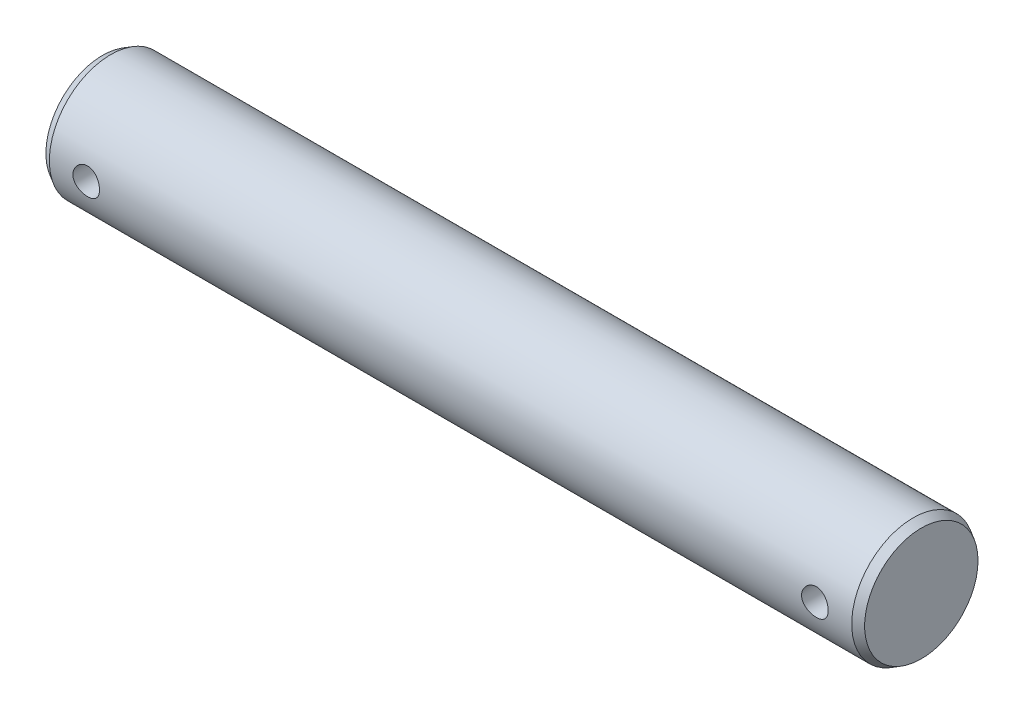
from build123d import *

# Parameters (mm, degrees)
ESQUISSE1_R      = 15
EXTRUSION1_DEPTH = 200
CHANFREIN1_SIZE  = 2
CHANFREIN1_SIZE2 = 1.154700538
ESQUISSE2_R      = 3.25
EXTRUSION2_DEPTH = 24


with BuildPart() as part:
    # Esquisse1 → Extrusion1 (new body)
    with BuildSketch(Plane(origin=(0, 0, 0), x_dir=(0, 0, -1), z_dir=(1, 0, 0))):
        Circle(ESQUISSE1_R)
    extrude(amount=EXTRUSION1_DEPTH)

    # Chanfrein1
    chanfrein1_edges = [part.edges().sort_by_distance(p)[0] for p in [
        (0, 0, 15),
        (200, 0, 15),
    ]]
    chanfrein1_side = [part.faces().sort_by_distance(p)[0] for p in [
        (100, 0, 15),
    ]]
    chamfer(chanfrein1_edges, length=CHANFREIN1_SIZE, length2=CHANFREIN1_SIZE2, reference=chanfrein1_side[0])

    # Esquisse2 → Extrusion2 (cut, symmetric)
    with BuildSketch(Plane.XY):
        with Locations((11, 0)):
            Circle(ESQUISSE2_R)
        with Locations((189, 0)):
            Circle(ESQUISSE2_R)
    extrude(amount=EXTRUSION2_DEPTH, both=True, mode=Mode.SUBTRACT)


solid = part.part
